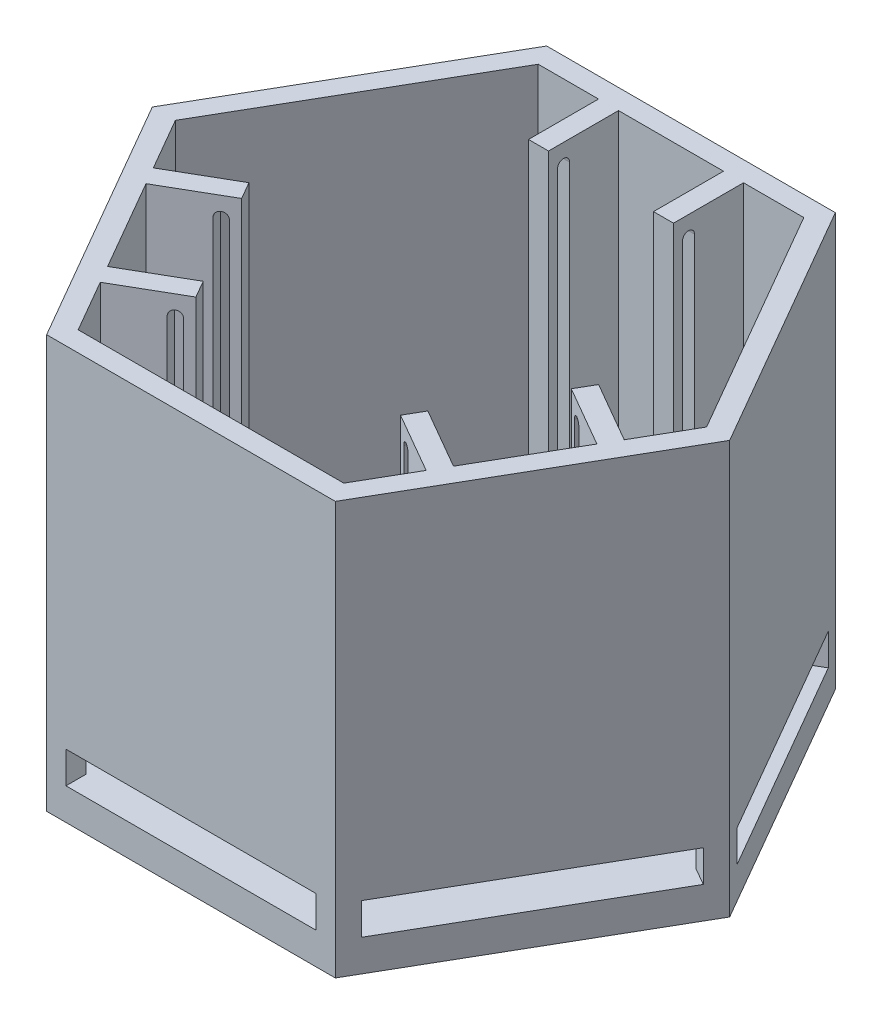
from build123d import *

# Parameters (mm, degrees)
BOSS_EXTRUDE1_DEPTH = 3.175
BOSS_EXTRUDE2_DEPTH = 38.1
SKETCH3_W           = 25
SKETCH3_H           = 3.175
CUT_EXTRUDE1_DEPTH  = 84.074
BOSS_EXTRUDE3_DEPTH = 30
CUT_EXTRUDE2_DEPTH  = 15
CIRPATTERN1_COUNT   = 3


with BuildPart() as part:
    # Sketch1 → Boss-Extrude1 (new body)
    with BuildSketch(Plane(origin=(0, 0, 0), x_dir=(1, 0, 0), z_dir=(0, 1, 0))):
        Polygon((28.867513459, 0), (14.43375673, 25), (-14.43375673, 25), (-28.867513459, 0), (-14.43375673, -25), (14.43375673, -25), align=None)
    extrude(amount=BOSS_EXTRUDE1_DEPTH)

    # Sketch2 → Boss-Extrude2 (add)
    with BuildSketch(Plane(origin=(0, 3.175, 0), x_dir=(1, 0, 0), z_dir=(0, 1, 0))):
        Polygon((14.43375673, -25), (28.867513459, 0), (14.43375673, 25), (-14.43375673, 25), (-28.867513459, 0), (-14.43375673, -25), align=None)
        Polygon((13.279056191, -23), (26.558112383, 0), (13.279056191, 23), (-13.279056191, 23), (-26.558112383, 0), (-13.279056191, -23), align=None, mode=Mode.SUBTRACT)
    extrude(amount=BOSS_EXTRUDE2_DEPTH)

    # Sketch3 → Cut-Extrude1 (cut)
    with BuildSketch(Plane(origin=(21.650635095, 0, 12.5), x_dir=(0.4999999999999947, 0, -0.8660254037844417), z_dir=(0.8660254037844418, 0, 0.49999999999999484))):
        with Locations((0, 4.7625)):
            Rectangle(SKETCH3_W, SKETCH3_H)
    cut_extrude1 = extrude(amount=-CUT_EXTRUDE1_DEPTH, mode=Mode.SUBTRACT)

    # Sketch4 → Boss-Extrude3 (add)
    with BuildSketch(Plane(origin=(0, 41.275, 0), x_dir=(1, 0, 0), z_dir=(0, 1, 0))):
        Polygon((23.543584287, -5.221315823), (17.481406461, -1.721315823), (16.481406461, -3.45336663), (22.543584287, -6.95336663), align=None)
        Polygon((17.293584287, -16.04663337), (11.231406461, -12.54663337), (10.231406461, -14.278684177), (16.293584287, -17.778684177), align=None)
    boss_extrude3 = extrude(amount=-BOSS_EXTRUDE3_DEPTH)

    # Sketch5 → Cut-Extrude2 (cut)
    with BuildSketch(Plane(origin=(3.625, 0, -6.278684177), x_dir=(-0.8660254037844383, 0, -0.5000000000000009), z_dir=(0.5000000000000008, 0, -0.8660254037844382))):
        with BuildLine():
            Line((-16.9, 39.275), (-16.9, 13.275))
            ThreePointArc((-16.9, 13.275), (-17.5, 12.675), (-18.1, 13.275))
            Line((-18.1, 13.275), (-18.1, 39.275))
            ThreePointArc((-18.1, 39.275), (-17.5, 39.875), (-16.9, 39.275))
        make_face()
    cut_extrude2 = extrude(amount=-CUT_EXTRUDE2_DEPTH, mode=Mode.SUBTRACT)

    # CirPattern1: Cut-Extrude1, Boss-Extrude3, Cut-Extrude2 ×3 about axis
    cirpattern1_axis = Axis((0, 0, 0), (0, 1, 0))
    add([cut_extrude1.rotate(cirpattern1_axis, i * 360 / CIRPATTERN1_COUNT) for i in range(1, CIRPATTERN1_COUNT)], mode=Mode.SUBTRACT)
    add([boss_extrude3.rotate(cirpattern1_axis, i * 360 / CIRPATTERN1_COUNT) for i in range(1, CIRPATTERN1_COUNT)])
    add([cut_extrude2.rotate(cirpattern1_axis, i * 360 / CIRPATTERN1_COUNT) for i in range(1, CIRPATTERN1_COUNT)], mode=Mode.SUBTRACT)


solid = part.part
